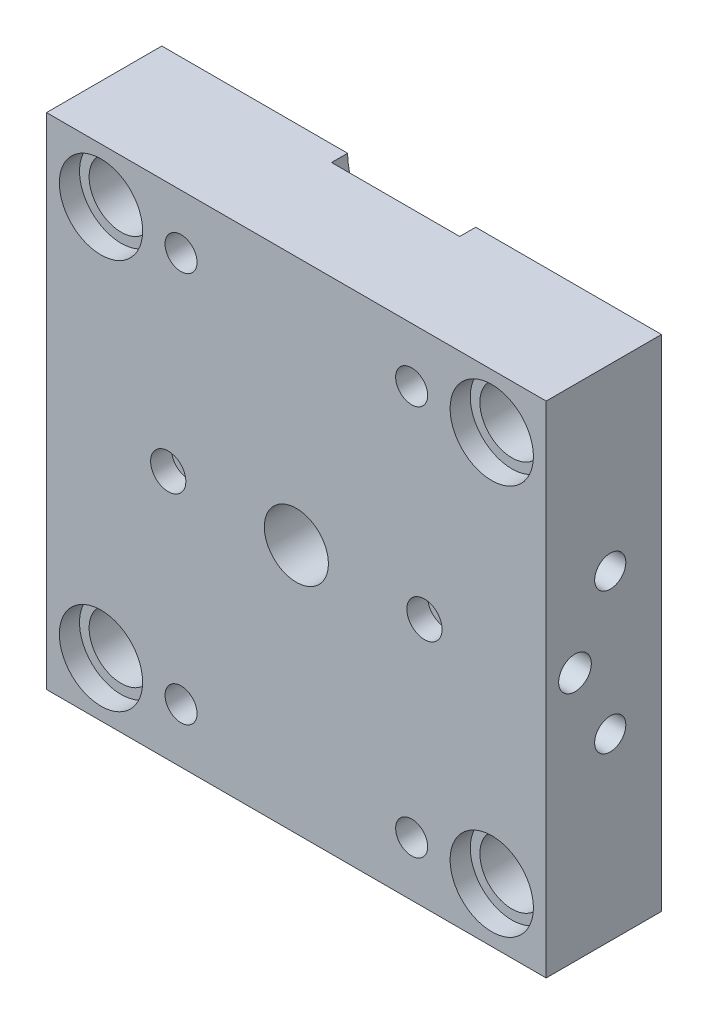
from build123d import *

# Parameters (mm, degrees)
ESQUISSE1_W                    = 156
ESQUISSE1_H                    = 156
EXTRUSION1_DEPTH               = 36
ESQUISSE2_R                    = 10
ENL_V_MAT_EXTRU_2_DEPTH        = 117.034477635
ESQUISSE3_R                    = 13
ENL_V_MAT_EXTRU_3_DEPTH        = 6.3
SYM_TRIE2_COPY_1_SKETCH_R      = 10
SYM_TRIE2_COPY_1_DEPTH         = 117.034477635
SYM_TRIE2_COPY_2_SKETCH_R      = 13
SYM_TRIE2_COPY_2_DEPTH         = 6.3
PASSAGE_PINCES_DEPTH           = 5
TROU_TARAUD_M12X1_751_D        = 10.2
TROU_TARAUD_M12X1_751_DEPTH    = 25
TROU_TARAUD_M12X1_751_TIP      = 3.064389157
TROU_TARAUD_1_8_RC1_AT_2_COUNT = 2
TROU_TARAUD_1_8_RC1_AT_2_PITCH = 44
ESQUISSE19_R                   = 10
ENL_V_MAT_EXTRU_4_DEPTH        = 117.034477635
ESQUISSE20_R                   = 6.5
ENL_V_MAT_EXTRU_5_DEPTH        = 15
ESQUISSE21_R                   = 3.25
ENL_V_MAT_EXTRU_6_DEPTH        = 113.289803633
ESQUISSE22_R                   = 5.5
ENL_V_MAT_EXTRU_7_DEPTH        = 6.5


with BuildPart() as part:
    # Esquisse1 → Extrusion1 (new body)
    with BuildSketch(Plane.XY):
        Rectangle(ESQUISSE1_W, ESQUISSE1_H)
    extrude(amount=EXTRUSION1_DEPTH)

    # Esquisse2 → Enl_v. mat.-Extru.2 (cut, through all)
    with BuildSketch(Plane.XY):
        with Locations((-61, 61)):
            Circle(ESQUISSE2_R)
    enl_v_mat_extru_2 = extrude(amount=ENL_V_MAT_EXTRU_2_DEPTH, mode=Mode.SUBTRACT)

    # Esquisse3 → Enl_v. mat.-Extru.3 (cut)
    with BuildSketch(Plane.XY.offset(36)):
        with Locations((-61, 61)):
            Circle(ESQUISSE3_R)
    enl_v_mat_extru_3 = extrude(amount=-ENL_V_MAT_EXTRU_3_DEPTH, mode=Mode.SUBTRACT)

    # Esquisse6 → Trou taraud_ M10x1.51 (revolve, cut)
    with BuildSketch(Plane(origin=(-36, 61, 36), x_dir=(0, -1, 0), z_dir=(1, 0, 0))):
        Polygon((0, 0), (0, 22.553657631), (4.25, 20), (4.25, 15), (5, 15), (5, 0), align=None)
    trou_taraud_m10x1_51 = revolve(axis=Axis((-36, 61, 42.35), (0, 0, -1)), mode=Mode.SUBTRACT)

    # Sym_trie1: Enl_v. mat.-Extru.2, Enl_v. mat.-Extru.3, Trou taraud_ M10x1.51 across plane
    add(enl_v_mat_extru_2.mirror(Plane(origin=(0, 0, 0), x_dir=(0, 0, 1), z_dir=(1, 0, 0))), mode=Mode.SUBTRACT)
    add(enl_v_mat_extru_3.mirror(Plane(origin=(0, 0, 0), x_dir=(0, 0, 1), z_dir=(1, 0, 0))), mode=Mode.SUBTRACT)
    add(trou_taraud_m10x1_51.mirror(Plane(origin=(0, 0, 0), x_dir=(0, 0, 1), z_dir=(1, 0, 0))), mode=Mode.SUBTRACT)

    # Sym_trie2: Enl_v. mat.-Extru.2, Enl_v. mat.-Extru.3, Trou taraud_ M10x1.51 across plane
    add(enl_v_mat_extru_2.mirror(Plane.ZX), mode=Mode.SUBTRACT)
    add(enl_v_mat_extru_3.mirror(Plane.ZX), mode=Mode.SUBTRACT)
    add(trou_taraud_m10x1_51.mirror(Plane.ZX), mode=Mode.SUBTRACT)

    # Sym_trie2 copy 1 sketch → Sym_trie2 copy 1 (cut, through all)
    with BuildSketch(Plane(origin=(0, 0, 0), x_dir=(-1, 0, 0), z_dir=(0, 0, 1))):
        with Locations((-61, 61)):
            Circle(SYM_TRIE2_COPY_1_SKETCH_R)
    extrude(amount=SYM_TRIE2_COPY_1_DEPTH, mode=Mode.SUBTRACT)

    # Sym_trie2 copy 2 sketch → Sym_trie2 copy 2 (cut)
    with BuildSketch(Plane(origin=(0, 0, 36), x_dir=(-1, 0, 0), z_dir=(0, 0, 1))):
        with Locations((-61, 61)):
            Circle(SYM_TRIE2_COPY_2_SKETCH_R)
    extrude(amount=-SYM_TRIE2_COPY_2_DEPTH, mode=Mode.SUBTRACT)

    # Sym_trie2 copy 3 sketch → Sym_trie2 copy 3 (revolve, cut)
    with BuildSketch(Plane(origin=(36, -61, 36), x_dir=(0, 1, 0), z_dir=(-1, 0, 0))):
        Polygon((0, 0), (0, 22.553657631), (4.25, 20), (4.25, 15), (5, 15), (5, 0), align=None)
    revolve(axis=Axis((36, -61, 42.35), (0, 0, -1)), mode=Mode.SUBTRACT)

    # Esquisse9 → passage pinces (cut)
    with BuildSketch(Plane(origin=(0, 0, 0), x_dir=(-1, 0, 0), z_dir=(0, 0, -1))):
        with BuildLine():
            Line((-20, 78), (20, 78))
            ThreePointArc((20, 78), (0, 58), (-20, 78))
        make_face()
        with BuildLine():
            Line((-20, -78), (20, -78))
            ThreePointArc((20, -78), (0, -58), (-20, -78))
        make_face()
    extrude(amount=-PASSAGE_PINCES_DEPTH, mode=Mode.SUBTRACT)

    # Trou taraud_ M12x1.751
    with Locations(Plane(origin=(78, 0, 0), x_dir=(0, 0, -1), z_dir=(1, 0, 0))):
        with Locations((-27, 0)):
            Hole(TROU_TARAUD_M12X1_751_D / 2, depth=TROU_TARAUD_M12X1_751_DEPTH)
            with Locations((0, 0, -(TROU_TARAUD_M12X1_751_DEPTH + TROU_TARAUD_M12X1_751_TIP / 2))):  # 118° drill point
                Cone(0, TROU_TARAUD_M12X1_751_D / 2, TROU_TARAUD_M12X1_751_TIP, mode=Mode.SUBTRACT)

    # Esquisse17 → Trou taraud_ 1_8 Rc1 (revolve, cut)
    with BuildSketch(Plane(origin=(-78, 22, 16), x_dir=(0, 0, 1), z_dir=(0, 1, 0))):
        Polygon((0, 0), (0, 80.373399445), (3.95, 78), (3.95, 7.4), (4.632997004, 7.4), (4.864, 0), align=None)
    trou_taraud_1_8_rc1 = revolve(axis=Axis((-84.35, 22, 16), (1, 0, 0)), mode=Mode.SUBTRACT)

    # Trou taraud_ 1_8 Rc1 at 2: Trou taraud_ 1_8 Rc1 ×2
    with Locations(*[(0, -i * TROU_TARAUD_1_8_RC1_AT_2_PITCH, 0) for i in range(1, TROU_TARAUD_1_8_RC1_AT_2_COUNT)]):
        add(trou_taraud_1_8_rc1, mode=Mode.SUBTRACT)

    # Sym_trie3: Trou taraud_ 1_8 Rc1 across plane
    add(trou_taraud_1_8_rc1.mirror(Plane(origin=(0, 0, 0), x_dir=(0, 0, 1), z_dir=(1, 0, 0))), mode=Mode.SUBTRACT)

    # Sym_trie3 copy 1 sketch → Sym_trie3 copy 1 (revolve, cut)
    with BuildSketch(Plane(origin=(78, -22, 16), x_dir=(0, 0, 1), z_dir=(0, 1, 0))):
        Polygon((0, 0), (0, -80.373399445), (3.95, -78), (3.95, -7.4), (4.632997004, -7.4), (4.864, 0), align=None)
    revolve(axis=Axis((84.35, -22, 16), (1, 0, 0)), mode=Mode.SUBTRACT)

    # Esquisse19 → Enl_v. mat.-Extru.4 (cut, through all)
    with BuildSketch(Plane(origin=(0, 0, 0), x_dir=(-1, 0, 0), z_dir=(0, 0, -1))):
        Circle(ESQUISSE19_R)
    extrude(amount=-ENL_V_MAT_EXTRU_4_DEPTH, mode=Mode.SUBTRACT)

    # Esquisse20 → Enl_v. mat.-Extru.5 (cut)
    with BuildSketch(Plane(origin=(0, 0, 0), x_dir=(-1, 0, 0), z_dir=(0, 0, -1))):
        with Locations((40, 0)):
            Circle(ESQUISSE20_R)
    enl_v_mat_extru_5 = extrude(amount=-ENL_V_MAT_EXTRU_5_DEPTH, mode=Mode.SUBTRACT)

    # Esquisse21 → Enl_v. mat.-Extru.6 (cut, through all)
    with BuildSketch(Plane(origin=(0, 0, 15), x_dir=(-1, 0, 0), z_dir=(0, 0, -1))):
        with Locations((40, 0)):
            Circle(ESQUISSE21_R)
    enl_v_mat_extru_6 = extrude(amount=-ENL_V_MAT_EXTRU_6_DEPTH, mode=Mode.SUBTRACT)

    # Esquisse22 → Enl_v. mat.-Extru.7 (cut)
    with BuildSketch(Plane.XY.offset(36)):
        with Locations((-40, 0)):
            Circle(ESQUISSE22_R)
    enl_v_mat_extru_7 = extrude(amount=-ENL_V_MAT_EXTRU_7_DEPTH, mode=Mode.SUBTRACT)

    # Sym_trie4: Enl_v. mat.-Extru.5, Enl_v. mat.-Extru.6, Enl_v. mat.-Extru.7 across plane
    add(enl_v_mat_extru_5.mirror(Plane(origin=(0, 0, 0), x_dir=(0, 0, 1), z_dir=(1, 0, 0))), mode=Mode.SUBTRACT)
    add(enl_v_mat_extru_6.mirror(Plane(origin=(0, 0, 0), x_dir=(0, 0, 1), z_dir=(1, 0, 0))), mode=Mode.SUBTRACT)
    add(enl_v_mat_extru_7.mirror(Plane(origin=(0, 0, 0), x_dir=(0, 0, 1), z_dir=(1, 0, 0))), mode=Mode.SUBTRACT)


solid = part.part
